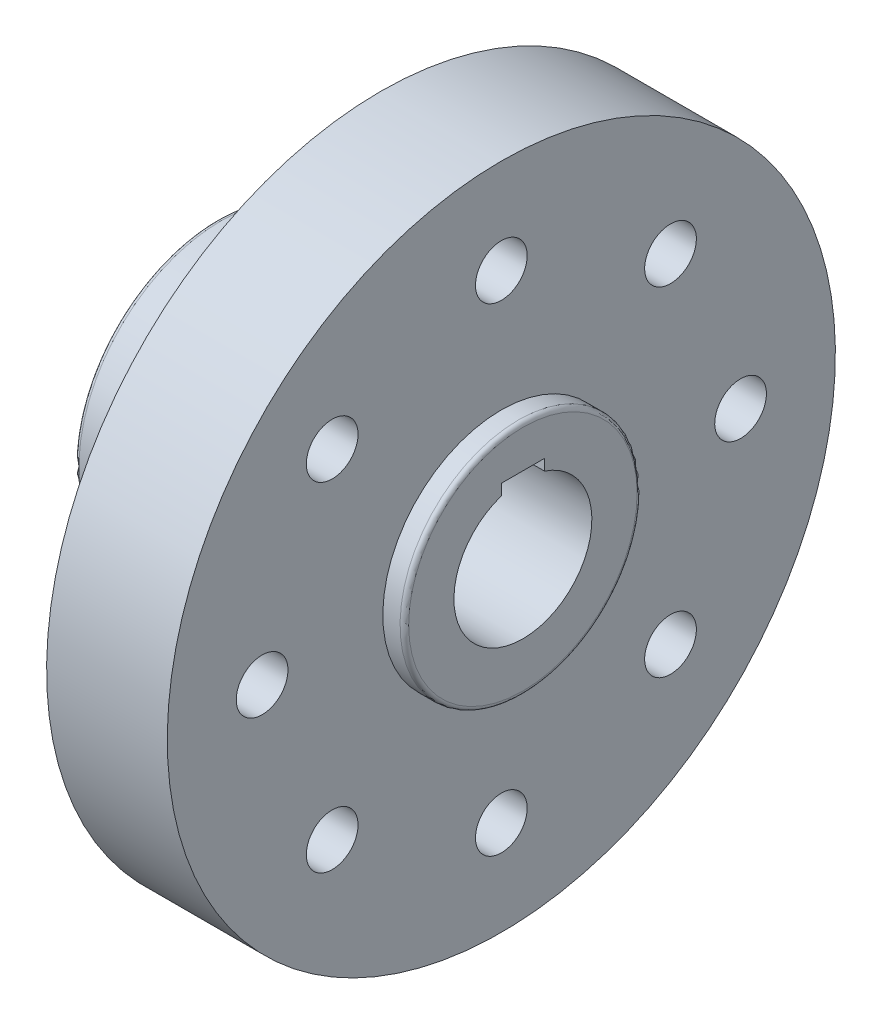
from build123d import *

# Parameters (mm, degrees)
SKETCH3_R          = 16
SKETCH3_W          = 10
SKETCH3_H          = 3.5
CUT_EXTRUDE2_DEPTH = 131.589050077
SKETCH4_R          = 6
CUT_EXTRUDE3_DEPTH = 128.939438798
FILLET1_R          = 5
FILLET2_R          = 2
FILLET3_R          = 1
CHAMFER1_SIZE      = 2


with BuildPart() as part:
    # Sketch2 → Revolve1 (revolve)
    with BuildSketch(Plane.XY):
        Polygon((29.114328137, 0), (29.114328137, 27.5), (24.114328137, 27.5), (24.114328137, 77.5), (-3.885671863, 77.5), (-3.885671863, 74.5), (10.114328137, 74.5), (10.114328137, 33), (-41.885671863, 33), (-41.885671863, 0), align=None)
    revolve(axis=Axis((29.114328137, 0, 0), (-1, 0, 0)))

    # Sketch3 → Cut-Extrude2 (cut, through all)
    with BuildSketch(Plane(origin=(29.114328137, 0, 0), x_dir=(0, 0, -1), z_dir=(1, 0, 0))):
        Circle(SKETCH3_R)
        with Locations((0, 16)):
            Rectangle(SKETCH3_W, SKETCH3_H)
    extrude(amount=-CUT_EXTRUDE2_DEPTH, mode=Mode.SUBTRACT)

    # Sketch4 → Cut-Extrude3 (cut, through all)
    with BuildSketch(Plane(origin=(24.114328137, 0, 0), x_dir=(0, 0, -1), z_dir=(1, 0, 0))):
        with Locations(Location((0, 55.5, 0), (0, 0, 90))):
            Circle(SKETCH4_R)
        with Locations(Location((39.244426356, 39.244426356, 0), (0, 0, 90))):
            Circle(SKETCH4_R)
        with Locations(Location((55.5, 0, 0), (0, 0, 90))):
            Circle(SKETCH4_R)
        with Locations(Location((39.244426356, -39.244426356, 0), (0, 0, 90))):
            Circle(SKETCH4_R)
        with Locations(Location((0, -55.5, 0), (0, 0, 90))):
            Circle(SKETCH4_R)
        with Locations(Location((-39.244426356, -39.244426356, 0), (0, 0, 90))):
            Circle(SKETCH4_R)
        with Locations(Location((-55.5, 0, 0), (0, 0, 90))):
            Circle(SKETCH4_R)
        with Locations(Location((-39.244426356, 39.244426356, 0), (0, 0, 90))):
            Circle(SKETCH4_R)
    extrude(amount=-CUT_EXTRUDE3_DEPTH, mode=Mode.SUBTRACT)

    # Fillet1
    fillet1_edges = [part.edges().sort_by_distance(p)[0] for p in [
        (10.114328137, -33, 0),
    ]]
    fillet(fillet1_edges, radius=FILLET1_R)

    # Fillet2
    fillet2_edges = [part.edges().sort_by_distance(p)[0] for p in [
        (10.114328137, -74.5, 0),
    ]]
    fillet(fillet2_edges, radius=FILLET2_R)

    # Fillet3
    fillet3_edges = [part.edges().sort_by_distance(p)[0] for p in [
        (29.114328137, -27.5, 0),
        (-41.885671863, -33, 0),
        (-3.885671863, -74.5, 0),
    ]]
    fillet(fillet3_edges, radius=FILLET3_R)

    # Chamfer1
    chamfer1_edges = [part.edges().sort_by_distance(p)[0] for p in [
        (-41.885671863, -16, 0),
    ]]
    chamfer(chamfer1_edges, length=CHAMFER1_SIZE)


solid = part.part
